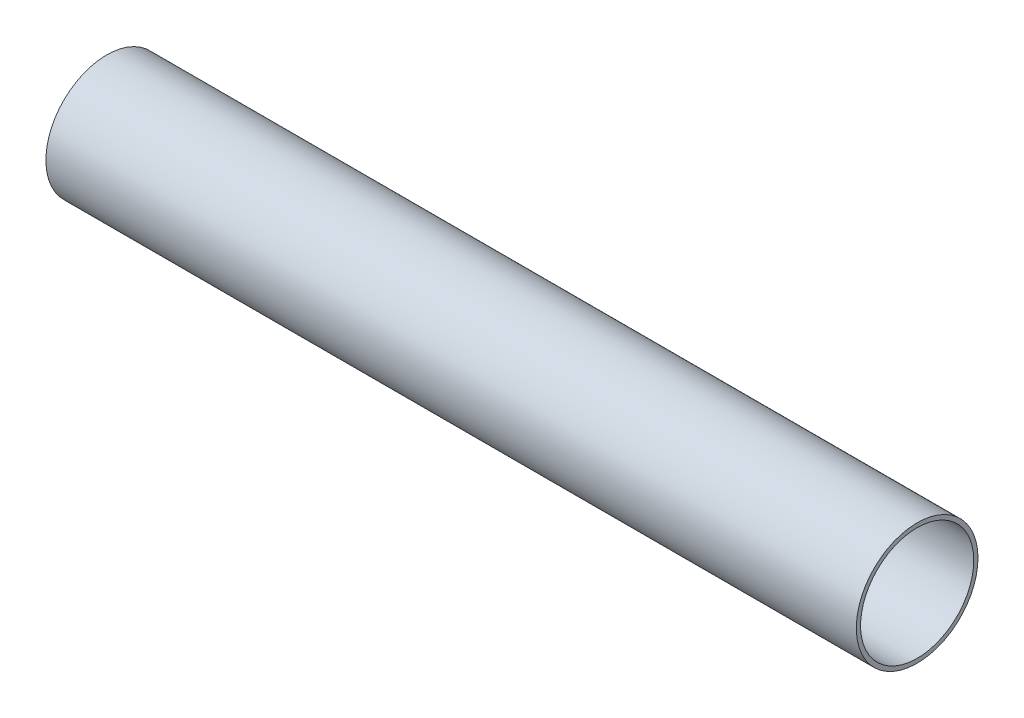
from build123d import *

# Parameters (mm, degrees)
SKETCH1_R      = 29.083
SKETCH1_R_2    = 27.051
EXTRUDE1_DEPTH = 387.35


with BuildPart() as part:
    # Sketch1 → Extrude1 (new body)
    with BuildSketch(Plane(origin=(0, 0, 0), x_dir=(0, 0, -1), z_dir=(1, 0, 0))):
        Circle(SKETCH1_R)
        Circle(SKETCH1_R_2, mode=Mode.SUBTRACT)
    extrude(amount=EXTRUDE1_DEPTH)


solid = part.part
